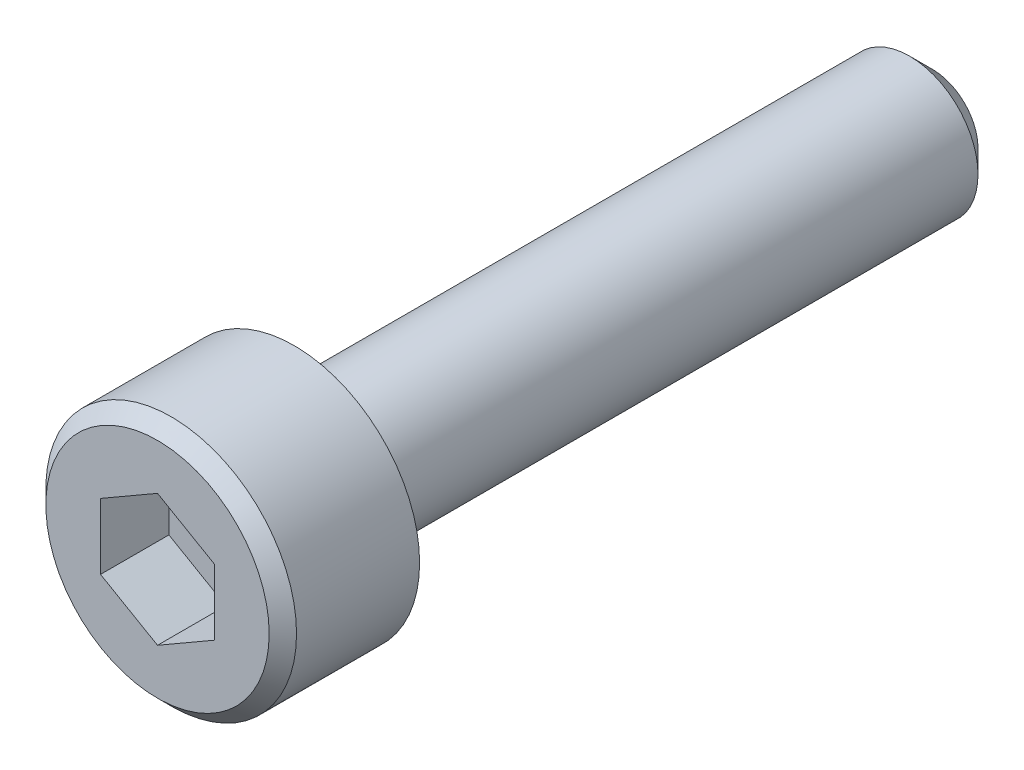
ISO-10303-21;
HEADER;
FILE_DESCRIPTION(('STEP AP214'),'2;1');
FILE_NAME('part.step','',(''),(''),'','','');
FILE_SCHEMA(('AUTOMOTIVE_DESIGN { 1 0 10303 214 1 1 1 1 }'));
ENDSEC;
DATA;
#1=APPLICATION_CONTEXT('core data for automotive mechanical design processes');
#2=APPLICATION_PROTOCOL_DEFINITION('international standard','automotive_design',2000,#1);
#3=PRODUCT_CONTEXT('',#1,'mechanical');
#4=PRODUCT('Part','Part','',(#3));
#5=PRODUCT_RELATED_PRODUCT_CATEGORY('part','',(#4));
#6=PRODUCT_DEFINITION_FORMATION('','',#4);
#7=PRODUCT_DEFINITION_CONTEXT('part definition',#1,'design');
#8=PRODUCT_DEFINITION('design','',#6,#7);
#9=PRODUCT_DEFINITION_SHAPE('','',#8);
#10=(LENGTH_UNIT() NAMED_UNIT(*) SI_UNIT(.MILLI.,.METRE.));
#11=(NAMED_UNIT(*) PLANE_ANGLE_UNIT() SI_UNIT($,.RADIAN.));
#12=(NAMED_UNIT(*) SI_UNIT($,.STERADIAN.) SOLID_ANGLE_UNIT());
#13=UNCERTAINTY_MEASURE_WITH_UNIT(LENGTH_MEASURE(1.E-05),#10,'distance_accuracy_value','');
#14=(GEOMETRIC_REPRESENTATION_CONTEXT(3) GLOBAL_UNCERTAINTY_ASSIGNED_CONTEXT((#13)) GLOBAL_UNIT_ASSIGNED_CONTEXT((#10,
#11,#12)) REPRESENTATION_CONTEXT('',''));
#15=CARTESIAN_POINT('',(0.,0.,0.));
#16=DIRECTION('',(0.,0.,1.));
#17=DIRECTION('',(1.,0.,0.));
#18=AXIS2_PLACEMENT_3D('',#15,#16,#17);
#19=CARTESIAN_POINT('',(0.,1.44337567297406,1.5));
#20=DIRECTION('',(-0.5,-0.86602540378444,0.));
#21=DIRECTION('',(0.86602540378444,-0.5,0.));
#22=AXIS2_PLACEMENT_3D('',#19,#20,#21);
#23=PLANE('',#22);
#24=DIRECTION('',(0.,0.,1.));
#25=VECTOR('',#24,1.);
#26=CARTESIAN_POINT('',(1.25,0.721687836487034,1.5));
#27=LINE('',#26,#25);
#28=CARTESIAN_POINT('',(1.25,0.721687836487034,1.5));
#29=VERTEX_POINT('',#28);
#30=CARTESIAN_POINT('',(1.25,0.721687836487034,3.));
#31=VERTEX_POINT('',#30);
#32=EDGE_CURVE('E63',#29,#31,#27,.T.);
#33=ORIENTED_EDGE('',*,*,#32,.T.);
#34=DIRECTION('',(0.866025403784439,-0.5,0.));
#35=VECTOR('',#34,1.);
#36=CARTESIAN_POINT('',(0.,1.44337567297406,3.));
#37=LINE('',#36,#35);
#38=CARTESIAN_POINT('',(0.,1.44337567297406,3.));
#39=VERTEX_POINT('',#38);
#40=EDGE_CURVE('E29',#39,#31,#37,.T.);
#41=ORIENTED_EDGE('',*,*,#40,.F.);
#42=DIRECTION('',(0.,0.,1.));
#43=VECTOR('',#42,1.);
#44=CARTESIAN_POINT('',(0.,1.44337567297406,1.5));
#45=LINE('',#44,#43);
#46=CARTESIAN_POINT('',(0.,1.44337567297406,1.5));
#47=VERTEX_POINT('',#46);
#48=EDGE_CURVE('E33',#47,#39,#45,.T.);
#49=ORIENTED_EDGE('',*,*,#48,.F.);
#50=DIRECTION('',(0.866025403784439,-0.5,0.));
#51=VECTOR('',#50,1.);
#52=CARTESIAN_POINT('',(0.,1.44337567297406,1.5));
#53=LINE('',#52,#51);
#54=EDGE_CURVE('E65',#47,#29,#53,.T.);
#55=ORIENTED_EDGE('',*,*,#54,.T.);
#56=EDGE_LOOP('',(#33,#41,#49,#55));
#57=FACE_BOUND('',#56,.T.);
#58=ADVANCED_FACE('F14',(#57),#23,.T.);
#59=CARTESIAN_POINT('',(1.25,-0.721687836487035,1.5));
#60=DIRECTION('',(1.,0.,0.));
#61=DIRECTION('',(0.,1.,0.));
#62=AXIS2_PLACEMENT_3D('',#59,#60,#61);
#63=PLANE('',#62);
#64=DIRECTION('',(0.,0.,1.));
#65=VECTOR('',#64,1.);
#66=CARTESIAN_POINT('',(1.25,-0.721687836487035,1.5));
#67=LINE('',#66,#65);
#68=CARTESIAN_POINT('',(1.25,-0.721687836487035,1.5));
#69=VERTEX_POINT('',#68);
#70=CARTESIAN_POINT('',(1.25,-0.721687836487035,3.));
#71=VERTEX_POINT('',#70);
#72=EDGE_CURVE('E70',#69,#71,#67,.T.);
#73=ORIENTED_EDGE('',*,*,#72,.T.);
#74=DIRECTION('',(0.,1.,0.));
#75=VECTOR('',#74,1.);
#76=CARTESIAN_POINT('',(1.25,-0.721687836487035,3.));
#77=LINE('',#76,#75);
#78=EDGE_CURVE('E73',#71,#31,#77,.T.);
#79=ORIENTED_EDGE('',*,*,#78,.T.);
#80=ORIENTED_EDGE('',*,*,#32,.F.);
#81=DIRECTION('',(0.,1.,0.));
#82=VECTOR('',#81,1.);
#83=CARTESIAN_POINT('',(1.25,-0.721687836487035,1.5));
#84=LINE('',#83,#82);
#85=EDGE_CURVE('E100',#69,#29,#84,.T.);
#86=ORIENTED_EDGE('',*,*,#85,.F.);
#87=EDGE_LOOP('',(#73,#79,#80,#86));
#88=FACE_BOUND('',#87,.T.);
#89=ADVANCED_FACE('F74',(#88),#63,.F.);
#90=CARTESIAN_POINT('',(0.,-1.44337567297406,1.5));
#91=DIRECTION('',(0.5,-0.86602540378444,0.));
#92=DIRECTION('',(0.86602540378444,0.5,0.));
#93=AXIS2_PLACEMENT_3D('',#90,#91,#92);
#94=PLANE('',#93);
#95=DIRECTION('',(0.,0.,1.));
#96=VECTOR('',#95,1.);
#97=CARTESIAN_POINT('',(0.,-1.44337567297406,1.5));
#98=LINE('',#97,#96);
#99=CARTESIAN_POINT('',(0.,-1.44337567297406,1.5));
#100=VERTEX_POINT('',#99);
#101=CARTESIAN_POINT('',(0.,-1.44337567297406,3.));
#102=VERTEX_POINT('',#101);
#103=EDGE_CURVE('E108',#100,#102,#98,.T.);
#104=ORIENTED_EDGE('',*,*,#103,.T.);
#105=DIRECTION('',(0.86602540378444,0.5,0.));
#106=VECTOR('',#105,1.);
#107=CARTESIAN_POINT('',(0.,-1.44337567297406,3.));
#108=LINE('',#107,#106);
#109=EDGE_CURVE('E78',#102,#71,#108,.T.);
#110=ORIENTED_EDGE('',*,*,#109,.T.);
#111=ORIENTED_EDGE('',*,*,#72,.F.);
#112=DIRECTION('',(0.86602540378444,0.5,0.));
#113=VECTOR('',#112,1.);
#114=CARTESIAN_POINT('',(0.,-1.44337567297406,1.5));
#115=LINE('',#114,#113);
#116=EDGE_CURVE('E97',#100,#69,#115,.T.);
#117=ORIENTED_EDGE('',*,*,#116,.F.);
#118=EDGE_LOOP('',(#104,#110,#111,#117));
#119=FACE_BOUND('',#118,.T.);
#120=ADVANCED_FACE('F142',(#119),#94,.F.);
#121=CARTESIAN_POINT('',(0.,-1.44337567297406,1.5));
#122=DIRECTION('',(0.5,0.86602540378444,0.));
#123=DIRECTION('',(-0.86602540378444,0.5,0.));
#124=AXIS2_PLACEMENT_3D('',#121,#122,#123);
#125=PLANE('',#124);
#126=DIRECTION('',(0.,0.,1.));
#127=VECTOR('',#126,1.);
#128=CARTESIAN_POINT('',(-1.25,-0.721687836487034,1.5));
#129=LINE('',#128,#127);
#130=CARTESIAN_POINT('',(-1.25,-0.721687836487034,1.5));
#131=VERTEX_POINT('',#130);
#132=CARTESIAN_POINT('',(-1.25,-0.721687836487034,3.));
#133=VERTEX_POINT('',#132);
#134=EDGE_CURVE('E106',#131,#133,#129,.T.);
#135=ORIENTED_EDGE('',*,*,#134,.T.);
#136=DIRECTION('',(-0.86602540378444,0.5,0.));
#137=VECTOR('',#136,1.);
#138=CARTESIAN_POINT('',(0.,-1.44337567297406,3.));
#139=LINE('',#138,#137);
#140=EDGE_CURVE('E337',#102,#133,#139,.T.);
#141=ORIENTED_EDGE('',*,*,#140,.F.);
#142=ORIENTED_EDGE('',*,*,#103,.F.);
#143=DIRECTION('',(-0.86602540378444,0.5,0.));
#144=VECTOR('',#143,1.);
#145=CARTESIAN_POINT('',(0.,-1.44337567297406,1.5));
#146=LINE('',#145,#144);
#147=EDGE_CURVE('E94',#100,#131,#146,.T.);
#148=ORIENTED_EDGE('',*,*,#147,.T.);
#149=EDGE_LOOP('',(#135,#141,#142,#148));
#150=FACE_BOUND('',#149,.T.);
#151=ADVANCED_FACE('F154',(#150),#125,.T.);
#152=CARTESIAN_POINT('',(-1.25,0.721687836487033,1.5));
#153=DIRECTION('',(-1.,0.,0.));
#154=DIRECTION('',(0.,-1.,0.));
#155=AXIS2_PLACEMENT_3D('',#152,#153,#154);
#156=PLANE('',#155);
#157=DIRECTION('',(0.,0.,1.));
#158=VECTOR('',#157,1.);
#159=CARTESIAN_POINT('',(-1.25,0.721687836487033,1.5));
#160=LINE('',#159,#158);
#161=CARTESIAN_POINT('',(-1.25,0.721687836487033,1.5));
#162=VERTEX_POINT('',#161);
#163=CARTESIAN_POINT('',(-1.25,0.721687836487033,3.));
#164=VERTEX_POINT('',#163);
#165=EDGE_CURVE('E104',#162,#164,#160,.T.);
#166=ORIENTED_EDGE('',*,*,#165,.T.);
#167=DIRECTION('',(0.,-1.,0.));
#168=VECTOR('',#167,1.);
#169=CARTESIAN_POINT('',(-1.25,0.721687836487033,3.));
#170=LINE('',#169,#168);
#171=EDGE_CURVE('E338',#164,#133,#170,.T.);
#172=ORIENTED_EDGE('',*,*,#171,.T.);
#173=ORIENTED_EDGE('',*,*,#134,.F.);
#174=DIRECTION('',(0.,-1.,0.));
#175=VECTOR('',#174,1.);
#176=CARTESIAN_POINT('',(-1.25,0.721687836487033,1.5));
#177=LINE('',#176,#175);
#178=EDGE_CURVE('E91',#162,#131,#177,.T.);
#179=ORIENTED_EDGE('',*,*,#178,.F.);
#180=EDGE_LOOP('',(#166,#172,#173,#179));
#181=FACE_BOUND('',#180,.T.);
#182=ADVANCED_FACE('F150',(#181),#156,.F.);
#183=CARTESIAN_POINT('',(0.,1.44337567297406,1.5));
#184=DIRECTION('',(-0.5,0.86602540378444,0.));
#185=DIRECTION('',(-0.86602540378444,-0.5,0.));
#186=AXIS2_PLACEMENT_3D('',#183,#184,#185);
#187=PLANE('',#186);
#188=DIRECTION('',(-0.86602540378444,-0.5,0.));
#189=VECTOR('',#188,1.);
#190=CARTESIAN_POINT('',(0.,1.44337567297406,1.5));
#191=LINE('',#190,#189);
#192=EDGE_CURVE('E88',#47,#162,#191,.T.);
#193=ORIENTED_EDGE('',*,*,#192,.F.);
#194=ORIENTED_EDGE('',*,*,#48,.T.);
#195=DIRECTION('',(-0.86602540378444,-0.5,0.));
#196=VECTOR('',#195,1.);
#197=CARTESIAN_POINT('',(0.,1.44337567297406,3.));
#198=LINE('',#197,#196);
#199=EDGE_CURVE('E84',#39,#164,#198,.T.);
#200=ORIENTED_EDGE('',*,*,#199,.T.);
#201=ORIENTED_EDGE('',*,*,#165,.F.);
#202=EDGE_LOOP('',(#193,#194,#200,#201));
#203=FACE_BOUND('',#202,.T.);
#204=ADVANCED_FACE('F147',(#203),#187,.F.);
#205=CARTESIAN_POINT('',(1.25,0.721687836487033,1.5));
#206=DIRECTION('',(0.,0.,1.));
#207=DIRECTION('',(1.,0.,0.));
#208=AXIS2_PLACEMENT_3D('',#205,#206,#207);
#209=PLANE('',#208);
#210=ORIENTED_EDGE('',*,*,#54,.F.);
#211=ORIENTED_EDGE('',*,*,#192,.T.);
#212=ORIENTED_EDGE('',*,*,#178,.T.);
#213=ORIENTED_EDGE('',*,*,#147,.F.);
#214=ORIENTED_EDGE('',*,*,#116,.T.);
#215=ORIENTED_EDGE('',*,*,#85,.T.);
#216=EDGE_LOOP('',(#210,#211,#212,#213,#214,#215));
#217=FACE_BOUND('',#216,.T.);
#218=ADVANCED_FACE('F146',(#217),#209,.T.);
#219=CARTESIAN_POINT('',(0.,0.,3.));
#220=DIRECTION('',(0.,0.,1.));
#221=DIRECTION('',(1.,0.,0.));
#222=AXIS2_PLACEMENT_3D('',#219,#220,#221);
#223=PLANE('',#222);
#224=CARTESIAN_POINT('',(0.,0.,3.));
#225=DIRECTION('',(0.,0.,1.));
#226=DIRECTION('',(1.,0.,0.));
#227=AXIS2_PLACEMENT_3D('',#224,#225,#226);
#228=CIRCLE('',#227,2.45);
#229=CARTESIAN_POINT('',(2.45,0.,3.));
#230=VERTEX_POINT('',#229);
#231=EDGE_CURVE('E116',#230,#230,#228,.T.);
#232=ORIENTED_EDGE('',*,*,#231,.T.);
#233=EDGE_LOOP('',(#232));
#234=FACE_BOUND('',#233,.T.);
#235=ORIENTED_EDGE('',*,*,#199,.F.);
#236=ORIENTED_EDGE('',*,*,#40,.T.);
#237=ORIENTED_EDGE('',*,*,#78,.F.);
#238=ORIENTED_EDGE('',*,*,#109,.F.);
#239=ORIENTED_EDGE('',*,*,#140,.T.);
#240=ORIENTED_EDGE('',*,*,#171,.F.);
#241=EDGE_LOOP('',(#235,#236,#237,#238,#239,#240));
#242=FACE_BOUND('',#241,.T.);
#243=ADVANCED_FACE('F81',(#234,#242),#223,.T.);
#244=CARTESIAN_POINT('',(0.,0.,8.));
#245=DIRECTION('',(0.,0.,1.));
#246=DIRECTION('',(1.,0.,0.));
#247=AXIS2_PLACEMENT_3D('',#244,#245,#246);
#248=CYLINDRICAL_SURFACE('',#247,2.75);
#249=CARTESIAN_POINT('',(0.,0.,2.7));
#250=DIRECTION('',(0.,0.,1.));
#251=DIRECTION('',(1.,0.,0.));
#252=AXIS2_PLACEMENT_3D('',#249,#250,#251);
#253=CIRCLE('',#252,2.75);
#254=CARTESIAN_POINT('',(2.75,0.,2.7));
#255=VERTEX_POINT('',#254);
#256=EDGE_CURVE('E119',#255,#255,#253,.F.);
#257=ORIENTED_EDGE('',*,*,#256,.T.);
#258=EDGE_LOOP('',(#257));
#259=FACE_BOUND('',#258,.T.);
#260=CARTESIAN_POINT('',(0.,0.,0.));
#261=DIRECTION('',(0.,0.,1.));
#262=DIRECTION('',(1.,0.,0.));
#263=AXIS2_PLACEMENT_3D('',#260,#261,#262);
#264=CIRCLE('',#263,2.75);
#265=CARTESIAN_POINT('',(2.75,0.,0.));
#266=VERTEX_POINT('',#265);
#267=EDGE_CURVE('E113',#266,#266,#264,.T.);
#268=ORIENTED_EDGE('',*,*,#267,.T.);
#269=EDGE_LOOP('',(#268));
#270=FACE_BOUND('',#269,.T.);
#271=ADVANCED_FACE('F169',(#259,#270),#248,.T.);
#272=CARTESIAN_POINT('',(2.75,0.,0.));
#273=DIRECTION('',(0.,0.,-1.));
#274=DIRECTION('',(-1.,0.,0.));
#275=AXIS2_PLACEMENT_3D('',#272,#273,#274);
#276=PLANE('',#275);
#277=CARTESIAN_POINT('',(0.,0.,0.));
#278=DIRECTION('',(0.,0.,1.));
#279=DIRECTION('',(1.,0.,0.));
#280=AXIS2_PLACEMENT_3D('',#277,#278,#279);
#281=CIRCLE('',#280,1.5);
#282=CARTESIAN_POINT('',(1.5,0.,0.));
#283=VERTEX_POINT('',#282);
#284=EDGE_CURVE('E69',#283,#283,#281,.T.);
#285=ORIENTED_EDGE('',*,*,#284,.T.);
#286=EDGE_LOOP('',(#285));
#287=FACE_BOUND('',#286,.T.);
#288=ORIENTED_EDGE('',*,*,#267,.F.);
#289=EDGE_LOOP('',(#288));
#290=FACE_BOUND('',#289,.T.);
#291=ADVANCED_FACE('F165',(#287,#290),#276,.T.);
#292=CARTESIAN_POINT('',(0.,0.,8.));
#293=DIRECTION('',(0.,0.,1.));
#294=DIRECTION('',(1.,0.,0.));
#295=AXIS2_PLACEMENT_3D('',#292,#293,#294);
#296=CYLINDRICAL_SURFACE('',#295,1.5);
#297=CARTESIAN_POINT('',(0.,0.,-13.5));
#298=DIRECTION('',(0.,0.,-1.));
#299=DIRECTION('',(-1.,0.,0.));
#300=AXIS2_PLACEMENT_3D('',#297,#298,#299);
#301=CIRCLE('',#300,1.5);
#302=CARTESIAN_POINT('',(-1.5,0.,-13.5));
#303=VERTEX_POINT('',#302);
#304=EDGE_CURVE('E9',#303,#303,#301,.F.);
#305=ORIENTED_EDGE('',*,*,#304,.T.);
#306=EDGE_LOOP('',(#305));
#307=FACE_BOUND('',#306,.T.);
#308=ORIENTED_EDGE('',*,*,#284,.F.);
#309=EDGE_LOOP('',(#308));
#310=FACE_BOUND('',#309,.T.);
#311=ADVANCED_FACE('F162',(#307,#310),#296,.T.);
#312=CARTESIAN_POINT('',(0.,0.,3.));
#313=DIRECTION('',(0.,0.,-1.));
#314=DIRECTION('',(-1.,0.,0.));
#315=AXIS2_PLACEMENT_3D('',#312,#313,#314);
#316=CONICAL_SURFACE('',#315,2.45,0.78539816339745);
#317=ORIENTED_EDGE('',*,*,#256,.F.);
#318=EDGE_LOOP('',(#317));
#319=FACE_BOUND('',#318,.T.);
#320=ORIENTED_EDGE('',*,*,#231,.F.);
#321=EDGE_LOOP('',(#320));
#322=FACE_BOUND('',#321,.T.);
#323=ADVANCED_FACE('F133',(#319,#322),#316,.T.);
#324=CARTESIAN_POINT('',(0.,0.,-14.));
#325=DIRECTION('',(0.,0.,-1.));
#326=DIRECTION('',(-1.,0.,0.));
#327=AXIS2_PLACEMENT_3D('',#324,#325,#326);
#328=PLANE('',#327);
#329=CARTESIAN_POINT('',(0.,0.,-14.));
#330=DIRECTION('',(0.,0.,-1.));
#331=DIRECTION('',(-1.,0.,0.));
#332=AXIS2_PLACEMENT_3D('',#329,#330,#331);
#333=CIRCLE('',#332,1.);
#334=CARTESIAN_POINT('',(-1.,0.,-14.));
#335=VERTEX_POINT('',#334);
#336=EDGE_CURVE('E22',#335,#335,#333,.T.);
#337=ORIENTED_EDGE('',*,*,#336,.T.);
#338=EDGE_LOOP('',(#337));
#339=FACE_BOUND('',#338,.T.);
#340=ADVANCED_FACE('F124',(#339),#328,.T.);
#341=CARTESIAN_POINT('',(0.,0.,-14.));
#342=DIRECTION('',(0.,0.,1.));
#343=DIRECTION('',(1.,0.,0.));
#344=AXIS2_PLACEMENT_3D('',#341,#342,#343);
#345=CONICAL_SURFACE('',#344,1.,0.785398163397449);
#346=ORIENTED_EDGE('',*,*,#304,.F.);
#347=EDGE_LOOP('',(#346));
#348=FACE_BOUND('',#347,.T.);
#349=ORIENTED_EDGE('',*,*,#336,.F.);
#350=EDGE_LOOP('',(#349));
#351=FACE_BOUND('',#350,.T.);
#352=ADVANCED_FACE('F16',(#348,#351),#345,.T.);
#353=CLOSED_SHELL('',(#58,#89,#120,#151,#182,#204,#218,#243,#271,#291,#311,#323,#340,#352));
#354=MANIFOLD_SOLID_BREP('B1',#353);
#355=ADVANCED_BREP_SHAPE_REPRESENTATION('',(#18,#354),#14);
#356=SHAPE_DEFINITION_REPRESENTATION(#9,#355);
ENDSEC;
END-ISO-10303-21;
